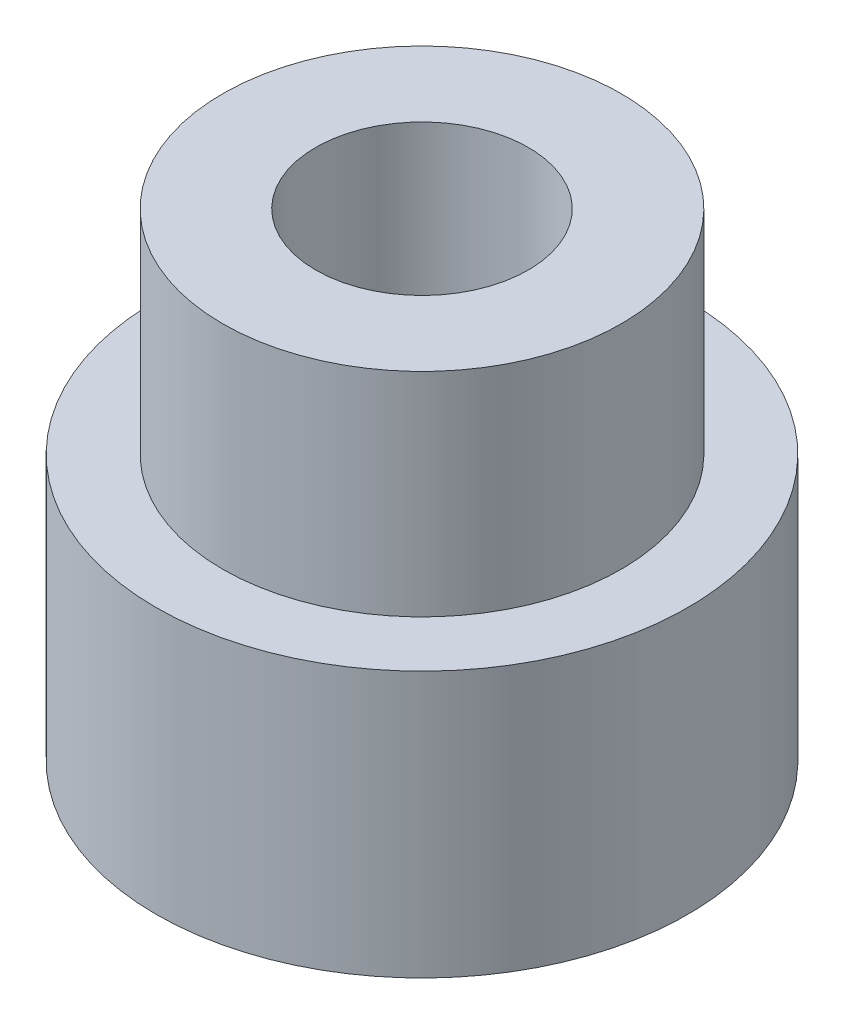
ISO-10303-21;
HEADER;
FILE_DESCRIPTION(('STEP AP214'),'2;1');
FILE_NAME('part.step','',(''),(''),'','','');
FILE_SCHEMA(('AUTOMOTIVE_DESIGN { 1 0 10303 214 1 1 1 1 }'));
ENDSEC;
DATA;
#1=APPLICATION_CONTEXT('core data for automotive mechanical design processes');
#2=APPLICATION_PROTOCOL_DEFINITION('international standard','automotive_design',2000,#1);
#3=PRODUCT_CONTEXT('',#1,'mechanical');
#4=PRODUCT('Part','Part','',(#3));
#5=PRODUCT_RELATED_PRODUCT_CATEGORY('part','',(#4));
#6=PRODUCT_DEFINITION_FORMATION('','',#4);
#7=PRODUCT_DEFINITION_CONTEXT('part definition',#1,'design');
#8=PRODUCT_DEFINITION('design','',#6,#7);
#9=PRODUCT_DEFINITION_SHAPE('','',#8);
#10=(LENGTH_UNIT() NAMED_UNIT(*) SI_UNIT(.MILLI.,.METRE.));
#11=(NAMED_UNIT(*) PLANE_ANGLE_UNIT() SI_UNIT($,.RADIAN.));
#12=(NAMED_UNIT(*) SI_UNIT($,.STERADIAN.) SOLID_ANGLE_UNIT());
#13=UNCERTAINTY_MEASURE_WITH_UNIT(LENGTH_MEASURE(1.E-05),#10,'distance_accuracy_value','');
#14=(GEOMETRIC_REPRESENTATION_CONTEXT(3) GLOBAL_UNCERTAINTY_ASSIGNED_CONTEXT((#13)) GLOBAL_UNIT_ASSIGNED_CONTEXT((#10,
#11,#12)) REPRESENTATION_CONTEXT('',''));
#15=CARTESIAN_POINT('',(0.,0.,0.));
#16=DIRECTION('',(0.,0.,1.));
#17=DIRECTION('',(1.,0.,0.));
#18=AXIS2_PLACEMENT_3D('',#15,#16,#17);
#19=CARTESIAN_POINT('',(0.,0.,0.));
#20=DIRECTION('',(0.,1.,0.));
#21=DIRECTION('',(0.,0.,1.));
#22=AXIS2_PLACEMENT_3D('',#19,#20,#21);
#23=CYLINDRICAL_SURFACE('',#22,15.);
#24=CARTESIAN_POINT('',(0.,36.,0.));
#25=DIRECTION('',(0.,1.,0.));
#26=DIRECTION('',(0.,0.,1.));
#27=AXIS2_PLACEMENT_3D('',#24,#25,#26);
#28=CIRCLE('',#27,15.);
#29=CARTESIAN_POINT('',(0.,36.,15.));
#30=VERTEX_POINT('',#29);
#31=EDGE_CURVE('E51',#30,#30,#28,.T.);
#32=ORIENTED_EDGE('',*,*,#31,.F.);
#33=EDGE_LOOP('',(#32));
#34=FACE_BOUND('',#33,.T.);
#35=CARTESIAN_POINT('',(0.,20.,0.));
#36=DIRECTION('',(0.,1.,0.));
#37=DIRECTION('',(0.,0.,1.));
#38=AXIS2_PLACEMENT_3D('',#35,#36,#37);
#39=CIRCLE('',#38,15.);
#40=CARTESIAN_POINT('',(0.,20.,15.));
#41=VERTEX_POINT('',#40);
#42=EDGE_CURVE('E10',#41,#41,#39,.T.);
#43=ORIENTED_EDGE('',*,*,#42,.T.);
#44=EDGE_LOOP('',(#43));
#45=FACE_BOUND('',#44,.T.);
#46=ADVANCED_FACE('F29',(#34,#45),#23,.T.);
#47=CARTESIAN_POINT('',(15.,20.,0.));
#48=DIRECTION('',(0.,-1.,0.));
#49=DIRECTION('',(0.,0.,-1.));
#50=AXIS2_PLACEMENT_3D('',#47,#48,#49);
#51=PLANE('',#50);
#52=ORIENTED_EDGE('',*,*,#42,.F.);
#53=EDGE_LOOP('',(#52));
#54=FACE_BOUND('',#53,.T.);
#55=CARTESIAN_POINT('',(0.,20.,0.));
#56=DIRECTION('',(0.,1.,0.));
#57=DIRECTION('',(0.,0.,1.));
#58=AXIS2_PLACEMENT_3D('',#55,#56,#57);
#59=CIRCLE('',#58,20.);
#60=CARTESIAN_POINT('',(0.,20.,20.));
#61=VERTEX_POINT('',#60);
#62=EDGE_CURVE('E35',#61,#61,#59,.T.);
#63=ORIENTED_EDGE('',*,*,#62,.T.);
#64=EDGE_LOOP('',(#63));
#65=FACE_BOUND('',#64,.T.);
#66=ADVANCED_FACE('F58',(#54,#65),#51,.F.);
#67=CARTESIAN_POINT('',(0.,0.,0.));
#68=DIRECTION('',(0.,1.,0.));
#69=DIRECTION('',(0.,0.,1.));
#70=AXIS2_PLACEMENT_3D('',#67,#68,#69);
#71=CYLINDRICAL_SURFACE('',#70,20.);
#72=ORIENTED_EDGE('',*,*,#62,.F.);
#73=EDGE_LOOP('',(#72));
#74=FACE_BOUND('',#73,.T.);
#75=CARTESIAN_POINT('',(0.,0.,0.));
#76=DIRECTION('',(0.,1.,0.));
#77=DIRECTION('',(0.,0.,1.));
#78=AXIS2_PLACEMENT_3D('',#75,#76,#77);
#79=CIRCLE('',#78,20.);
#80=CARTESIAN_POINT('',(0.,0.,20.));
#81=VERTEX_POINT('',#80);
#82=EDGE_CURVE('E39',#81,#81,#79,.T.);
#83=ORIENTED_EDGE('',*,*,#82,.T.);
#84=EDGE_LOOP('',(#83));
#85=FACE_BOUND('',#84,.T.);
#86=ADVANCED_FACE('F62',(#74,#85),#71,.T.);
#87=CARTESIAN_POINT('',(8.,0.,0.));
#88=DIRECTION('',(0.,1.,0.));
#89=DIRECTION('',(0.,0.,1.));
#90=AXIS2_PLACEMENT_3D('',#87,#88,#89);
#91=PLANE('',#90);
#92=ORIENTED_EDGE('',*,*,#82,.F.);
#93=EDGE_LOOP('',(#92));
#94=FACE_BOUND('',#93,.T.);
#95=CARTESIAN_POINT('',(0.,0.,0.));
#96=DIRECTION('',(0.,1.,0.));
#97=DIRECTION('',(0.,0.,1.));
#98=AXIS2_PLACEMENT_3D('',#95,#96,#97);
#99=CIRCLE('',#98,8.);
#100=CARTESIAN_POINT('',(0.,0.,8.));
#101=VERTEX_POINT('',#100);
#102=EDGE_CURVE('E43',#101,#101,#99,.T.);
#103=ORIENTED_EDGE('',*,*,#102,.T.);
#104=EDGE_LOOP('',(#103));
#105=FACE_BOUND('',#104,.T.);
#106=ADVANCED_FACE('F67',(#94,#105),#91,.F.);
#107=CARTESIAN_POINT('',(0.,0.,0.));
#108=DIRECTION('',(0.,1.,0.));
#109=DIRECTION('',(0.,0.,1.));
#110=AXIS2_PLACEMENT_3D('',#107,#108,#109);
#111=CYLINDRICAL_SURFACE('',#110,8.);
#112=ORIENTED_EDGE('',*,*,#102,.F.);
#113=EDGE_LOOP('',(#112));
#114=FACE_BOUND('',#113,.T.);
#115=CARTESIAN_POINT('',(0.,36.,0.));
#116=DIRECTION('',(0.,1.,0.));
#117=DIRECTION('',(0.,0.,1.));
#118=AXIS2_PLACEMENT_3D('',#115,#116,#117);
#119=CIRCLE('',#118,7.99999999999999);
#120=CARTESIAN_POINT('',(0.,36.,7.99999999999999));
#121=VERTEX_POINT('',#120);
#122=EDGE_CURVE('E48',#121,#121,#119,.T.);
#123=ORIENTED_EDGE('',*,*,#122,.T.);
#124=EDGE_LOOP('',(#123));
#125=FACE_BOUND('',#124,.T.);
#126=ADVANCED_FACE('F73',(#114,#125),#111,.F.);
#127=CARTESIAN_POINT('',(7.99999999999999,36.,0.));
#128=DIRECTION('',(0.,-1.,0.));
#129=DIRECTION('',(0.,0.,-1.));
#130=AXIS2_PLACEMENT_3D('',#127,#128,#129);
#131=PLANE('',#130);
#132=ORIENTED_EDGE('',*,*,#122,.F.);
#133=EDGE_LOOP('',(#132));
#134=FACE_BOUND('',#133,.T.);
#135=ORIENTED_EDGE('',*,*,#31,.T.);
#136=EDGE_LOOP('',(#135));
#137=FACE_BOUND('',#136,.T.);
#138=ADVANCED_FACE('F55',(#134,#137),#131,.F.);
#139=CLOSED_SHELL('',(#46,#66,#86,#106,#126,#138));
#140=MANIFOLD_SOLID_BREP('B2',#139);
#141=ADVANCED_BREP_SHAPE_REPRESENTATION('',(#18,#140),#14);
#142=SHAPE_DEFINITION_REPRESENTATION(#9,#141);
ENDSEC;
END-ISO-10303-21;
